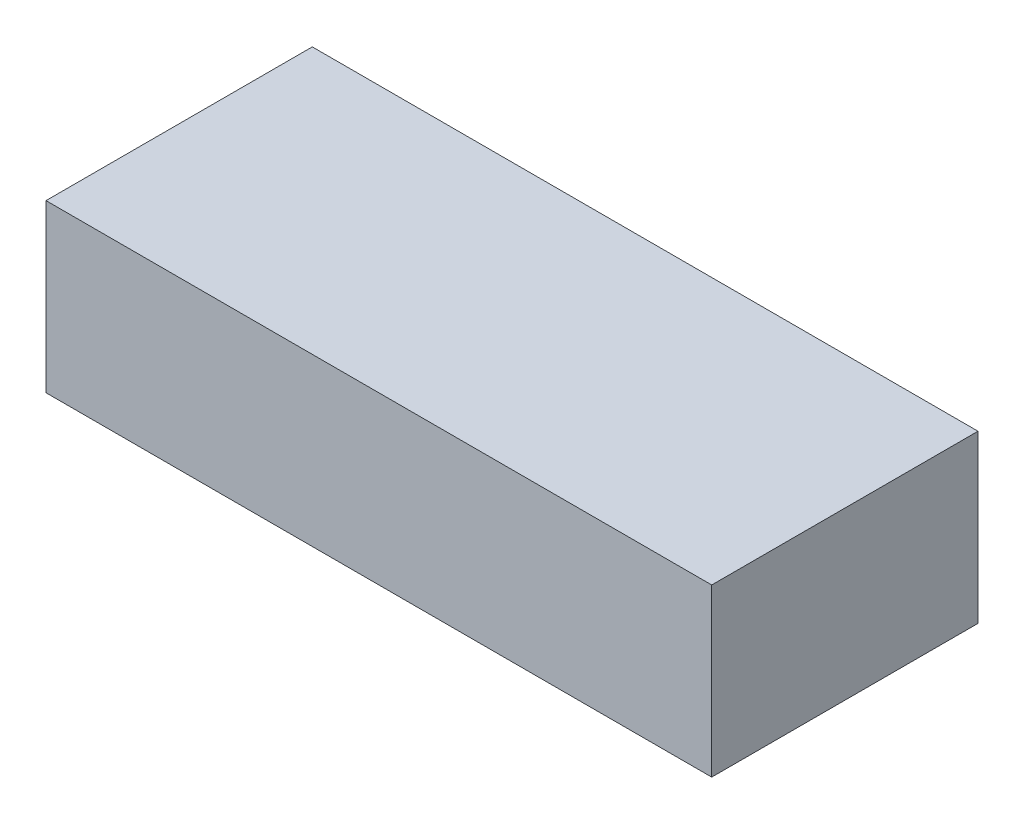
ISO-10303-21;
HEADER;
FILE_DESCRIPTION(('STEP AP214'),'2;1');
FILE_NAME('part.step','',(''),(''),'','','');
FILE_SCHEMA(('AUTOMOTIVE_DESIGN { 1 0 10303 214 1 1 1 1 }'));
ENDSEC;
DATA;
#1=APPLICATION_CONTEXT('core data for automotive mechanical design processes');
#2=APPLICATION_PROTOCOL_DEFINITION('international standard','automotive_design',2000,#1);
#3=PRODUCT_CONTEXT('',#1,'mechanical');
#4=PRODUCT('Part','Part','',(#3));
#5=PRODUCT_RELATED_PRODUCT_CATEGORY('part','',(#4));
#6=PRODUCT_DEFINITION_FORMATION('','',#4);
#7=PRODUCT_DEFINITION_CONTEXT('part definition',#1,'design');
#8=PRODUCT_DEFINITION('design','',#6,#7);
#9=PRODUCT_DEFINITION_SHAPE('','',#8);
#10=(LENGTH_UNIT() NAMED_UNIT(*) SI_UNIT(.MILLI.,.METRE.));
#11=(NAMED_UNIT(*) PLANE_ANGLE_UNIT() SI_UNIT($,.RADIAN.));
#12=(NAMED_UNIT(*) SI_UNIT($,.STERADIAN.) SOLID_ANGLE_UNIT());
#13=UNCERTAINTY_MEASURE_WITH_UNIT(LENGTH_MEASURE(1.E-05),#10,'distance_accuracy_value','');
#14=(GEOMETRIC_REPRESENTATION_CONTEXT(3) GLOBAL_UNCERTAINTY_ASSIGNED_CONTEXT((#13)) GLOBAL_UNIT_ASSIGNED_CONTEXT((#10,
#11,#12)) REPRESENTATION_CONTEXT('',''));
#15=CARTESIAN_POINT('',(0.,0.,0.));
#16=DIRECTION('',(0.,0.,1.));
#17=DIRECTION('',(1.,0.,0.));
#18=AXIS2_PLACEMENT_3D('',#15,#16,#17);
#19=CARTESIAN_POINT('',(0.,0.,8.));
#20=DIRECTION('',(1.,0.,0.));
#21=DIRECTION('',(0.,1.,0.));
#22=AXIS2_PLACEMENT_3D('',#19,#20,#21);
#23=PLANE('',#22);
#24=DIRECTION('',(0.,-1.,0.));
#25=VECTOR('',#24,1.);
#26=CARTESIAN_POINT('',(0.,0.,0.));
#27=LINE('',#26,#25);
#28=CARTESIAN_POINT('',(0.,5.,0.));
#29=VERTEX_POINT('',#28);
#30=CARTESIAN_POINT('',(0.,0.,0.));
#31=VERTEX_POINT('',#30);
#32=EDGE_CURVE('E94',#29,#31,#27,.T.);
#33=ORIENTED_EDGE('',*,*,#32,.T.);
#34=DIRECTION('',(0.,0.,-1.));
#35=VECTOR('',#34,1.);
#36=CARTESIAN_POINT('',(0.,0.,8.));
#37=LINE('',#36,#35);
#38=CARTESIAN_POINT('',(0.,0.,8.));
#39=VERTEX_POINT('',#38);
#40=EDGE_CURVE('E11',#39,#31,#37,.T.);
#41=ORIENTED_EDGE('',*,*,#40,.F.);
#42=DIRECTION('',(0.,-1.,0.));
#43=VECTOR('',#42,1.);
#44=CARTESIAN_POINT('',(0.,0.,8.));
#45=LINE('',#44,#43);
#46=CARTESIAN_POINT('',(0.,5.,8.));
#47=VERTEX_POINT('',#46);
#48=EDGE_CURVE('E82',#47,#39,#45,.T.);
#49=ORIENTED_EDGE('',*,*,#48,.F.);
#50=DIRECTION('',(0.,0.,-1.));
#51=VECTOR('',#50,1.);
#52=CARTESIAN_POINT('',(0.,5.,8.));
#53=LINE('',#52,#51);
#54=EDGE_CURVE('E90',#47,#29,#53,.T.);
#55=ORIENTED_EDGE('',*,*,#54,.T.);
#56=EDGE_LOOP('',(#33,#41,#49,#55));
#57=FACE_BOUND('',#56,.T.);
#58=ADVANCED_FACE('F31',(#57),#23,.F.);
#59=CARTESIAN_POINT('',(0.,0.,8.));
#60=DIRECTION('',(0.,1.,0.));
#61=DIRECTION('',(0.,0.,1.));
#62=AXIS2_PLACEMENT_3D('',#59,#60,#61);
#63=PLANE('',#62);
#64=DIRECTION('',(1.,0.,0.));
#65=VECTOR('',#64,1.);
#66=CARTESIAN_POINT('',(0.,0.,0.));
#67=LINE('',#66,#65);
#68=CARTESIAN_POINT('',(20.,0.,0.));
#69=VERTEX_POINT('',#68);
#70=EDGE_CURVE('E86',#31,#69,#67,.T.);
#71=ORIENTED_EDGE('',*,*,#70,.T.);
#72=DIRECTION('',(0.,0.,-1.));
#73=VECTOR('',#72,1.);
#74=CARTESIAN_POINT('',(20.,0.,8.));
#75=LINE('',#74,#73);
#76=CARTESIAN_POINT('',(20.,0.,8.));
#77=VERTEX_POINT('',#76);
#78=EDGE_CURVE('E39',#77,#69,#75,.T.);
#79=ORIENTED_EDGE('',*,*,#78,.F.);
#80=DIRECTION('',(1.,0.,0.));
#81=VECTOR('',#80,1.);
#82=CARTESIAN_POINT('',(0.,0.,8.));
#83=LINE('',#82,#81);
#84=EDGE_CURVE('E77',#39,#77,#83,.T.);
#85=ORIENTED_EDGE('',*,*,#84,.F.);
#86=ORIENTED_EDGE('',*,*,#40,.T.);
#87=EDGE_LOOP('',(#71,#79,#85,#86));
#88=FACE_BOUND('',#87,.T.);
#89=ADVANCED_FACE('F85',(#88),#63,.F.);
#90=CARTESIAN_POINT('',(20.,0.,8.));
#91=DIRECTION('',(-1.,0.,0.));
#92=DIRECTION('',(0.,-1.,0.));
#93=AXIS2_PLACEMENT_3D('',#90,#91,#92);
#94=PLANE('',#93);
#95=DIRECTION('',(0.,1.,0.));
#96=VECTOR('',#95,1.);
#97=CARTESIAN_POINT('',(20.,0.,0.));
#98=LINE('',#97,#96);
#99=CARTESIAN_POINT('',(20.,5.,0.));
#100=VERTEX_POINT('',#99);
#101=EDGE_CURVE('E64',#69,#100,#98,.T.);
#102=ORIENTED_EDGE('',*,*,#101,.T.);
#103=DIRECTION('',(0.,0.,-1.));
#104=VECTOR('',#103,1.);
#105=CARTESIAN_POINT('',(20.,5.,8.));
#106=LINE('',#105,#104);
#107=CARTESIAN_POINT('',(20.,5.,8.));
#108=VERTEX_POINT('',#107);
#109=EDGE_CURVE('E87',#108,#100,#106,.T.);
#110=ORIENTED_EDGE('',*,*,#109,.F.);
#111=DIRECTION('',(0.,1.,0.));
#112=VECTOR('',#111,1.);
#113=CARTESIAN_POINT('',(20.,0.,8.));
#114=LINE('',#113,#112);
#115=EDGE_CURVE('E80',#77,#108,#114,.T.);
#116=ORIENTED_EDGE('',*,*,#115,.F.);
#117=ORIENTED_EDGE('',*,*,#78,.T.);
#118=EDGE_LOOP('',(#102,#110,#116,#117));
#119=FACE_BOUND('',#118,.T.);
#120=ADVANCED_FACE('F88',(#119),#94,.F.);
#121=CARTESIAN_POINT('',(0.,5.,8.));
#122=DIRECTION('',(0.,-1.,0.));
#123=DIRECTION('',(0.,0.,-1.));
#124=AXIS2_PLACEMENT_3D('',#121,#122,#123);
#125=PLANE('',#124);
#126=DIRECTION('',(-1.,0.,0.));
#127=VECTOR('',#126,1.);
#128=CARTESIAN_POINT('',(0.,5.,0.));
#129=LINE('',#128,#127);
#130=EDGE_CURVE('E70',#100,#29,#129,.T.);
#131=ORIENTED_EDGE('',*,*,#130,.T.);
#132=ORIENTED_EDGE('',*,*,#54,.F.);
#133=DIRECTION('',(-1.,0.,0.));
#134=VECTOR('',#133,1.);
#135=CARTESIAN_POINT('',(0.,5.,8.));
#136=LINE('',#135,#134);
#137=EDGE_CURVE('E47',#108,#47,#136,.T.);
#138=ORIENTED_EDGE('',*,*,#137,.F.);
#139=ORIENTED_EDGE('',*,*,#109,.T.);
#140=EDGE_LOOP('',(#131,#132,#138,#139));
#141=FACE_BOUND('',#140,.T.);
#142=ADVANCED_FACE('F101',(#141),#125,.F.);
#143=CARTESIAN_POINT('',(0.,5.,8.));
#144=DIRECTION('',(0.,0.,-1.));
#145=DIRECTION('',(-1.,0.,0.));
#146=AXIS2_PLACEMENT_3D('',#143,#144,#145);
#147=PLANE('',#146);
#148=ORIENTED_EDGE('',*,*,#48,.T.);
#149=ORIENTED_EDGE('',*,*,#84,.T.);
#150=ORIENTED_EDGE('',*,*,#115,.T.);
#151=ORIENTED_EDGE('',*,*,#137,.T.);
#152=EDGE_LOOP('',(#148,#149,#150,#151));
#153=FACE_BOUND('',#152,.T.);
#154=ADVANCED_FACE('F78',(#153),#147,.F.);
#155=CARTESIAN_POINT('',(0.,5.,0.));
#156=DIRECTION('',(0.,0.,-1.));
#157=DIRECTION('',(-1.,0.,0.));
#158=AXIS2_PLACEMENT_3D('',#155,#156,#157);
#159=PLANE('',#158);
#160=ORIENTED_EDGE('',*,*,#32,.F.);
#161=ORIENTED_EDGE('',*,*,#130,.F.);
#162=ORIENTED_EDGE('',*,*,#101,.F.);
#163=ORIENTED_EDGE('',*,*,#70,.F.);
#164=EDGE_LOOP('',(#160,#161,#162,#163));
#165=FACE_BOUND('',#164,.T.);
#166=ADVANCED_FACE('F104',(#165),#159,.T.);
#167=CLOSED_SHELL('',(#58,#89,#120,#142,#154,#166));
#168=MANIFOLD_SOLID_BREP('B2',#167);
#169=ADVANCED_BREP_SHAPE_REPRESENTATION('',(#18,#168),#14);
#170=SHAPE_DEFINITION_REPRESENTATION(#9,#169);
ENDSEC;
END-ISO-10303-21;
